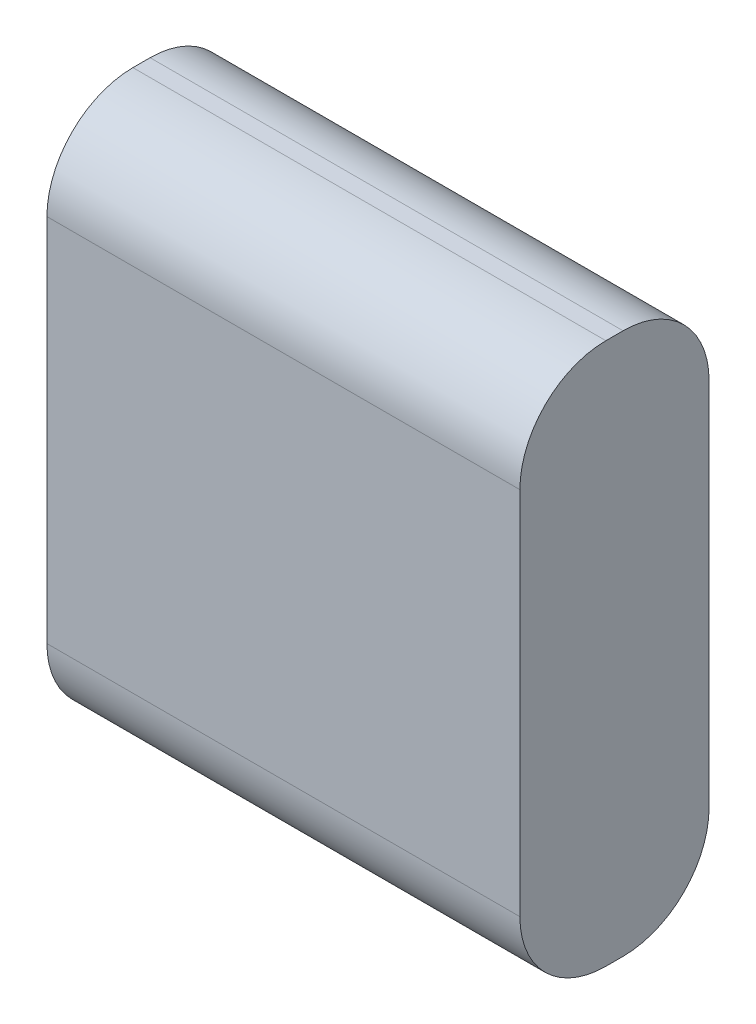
ISO-10303-21;
HEADER;
FILE_DESCRIPTION(('STEP AP214'),'2;1');
FILE_NAME('part.step','',(''),(''),'','','');
FILE_SCHEMA(('AUTOMOTIVE_DESIGN { 1 0 10303 214 1 1 1 1 }'));
ENDSEC;
DATA;
#1=APPLICATION_CONTEXT('core data for automotive mechanical design processes');
#2=APPLICATION_PROTOCOL_DEFINITION('international standard','automotive_design',2000,#1);
#3=PRODUCT_CONTEXT('',#1,'mechanical');
#4=PRODUCT('Part','Part','',(#3));
#5=PRODUCT_RELATED_PRODUCT_CATEGORY('part','',(#4));
#6=PRODUCT_DEFINITION_FORMATION('','',#4);
#7=PRODUCT_DEFINITION_CONTEXT('part definition',#1,'design');
#8=PRODUCT_DEFINITION('design','',#6,#7);
#9=PRODUCT_DEFINITION_SHAPE('','',#8);
#10=(LENGTH_UNIT() NAMED_UNIT(*) SI_UNIT(.MILLI.,.METRE.));
#11=(NAMED_UNIT(*) PLANE_ANGLE_UNIT() SI_UNIT($,.RADIAN.));
#12=(NAMED_UNIT(*) SI_UNIT($,.STERADIAN.) SOLID_ANGLE_UNIT());
#13=UNCERTAINTY_MEASURE_WITH_UNIT(LENGTH_MEASURE(1.E-05),#10,'distance_accuracy_value','');
#14=(GEOMETRIC_REPRESENTATION_CONTEXT(3) GLOBAL_UNCERTAINTY_ASSIGNED_CONTEXT((#13)) GLOBAL_UNIT_ASSIGNED_CONTEXT((#10,
#11,#12)) REPRESENTATION_CONTEXT('',''));
#15=CARTESIAN_POINT('',(0.,0.,0.));
#16=DIRECTION('',(0.,0.,1.));
#17=DIRECTION('',(1.,0.,0.));
#18=AXIS2_PLACEMENT_3D('',#15,#16,#17);
#19=CARTESIAN_POINT('',(8.95015274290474,27.3200326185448,2.2));
#20=DIRECTION('',(-1.,0.,0.));
#21=DIRECTION('',(0.,0.,1.));
#22=AXIS2_PLACEMENT_3D('',#19,#20,#21);
#23=PLANE('',#22);
#24=DIRECTION('',(0.,0.,-1.));
#25=VECTOR('',#24,1.);
#26=CARTESIAN_POINT('',(8.95015274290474,27.3200326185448,2.2));
#27=LINE('',#26,#25);
#28=CARTESIAN_POINT('',(8.95015274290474,27.3200326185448,1.2));
#29=VERTEX_POINT('',#28);
#30=CARTESIAN_POINT('',(8.95015274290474,27.3200326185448,1.));
#31=VERTEX_POINT('',#30);
#32=EDGE_CURVE('E85',#29,#31,#27,.T.);
#33=ORIENTED_EDGE('',*,*,#32,.T.);
#34=CARTESIAN_POINT('',(8.95015274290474,28.3200326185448,1.));
#35=DIRECTION('',(-1.,0.,0.));
#36=DIRECTION('',(0.,0.,1.));
#37=AXIS2_PLACEMENT_3D('',#34,#35,#36);
#38=CIRCLE('',#37,1.);
#39=CARTESIAN_POINT('',(8.95015274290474,28.3200326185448,0.));
#40=VERTEX_POINT('',#39);
#41=EDGE_CURVE('E92',#31,#40,#38,.F.);
#42=ORIENTED_EDGE('',*,*,#41,.T.);
#43=DIRECTION('',(0.,1.,0.));
#44=VECTOR('',#43,1.);
#45=CARTESIAN_POINT('',(8.95015274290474,27.3200326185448,0.));
#46=LINE('',#45,#44);
#47=CARTESIAN_POINT('',(8.95015274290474,32.6200326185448,0.));
#48=VERTEX_POINT('',#47);
#49=EDGE_CURVE('E146',#40,#48,#46,.T.);
#50=ORIENTED_EDGE('',*,*,#49,.T.);
#51=CARTESIAN_POINT('',(8.95015274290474,32.6200326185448,1.));
#52=DIRECTION('',(-1.,0.,0.));
#53=DIRECTION('',(0.,0.,1.));
#54=AXIS2_PLACEMENT_3D('',#51,#52,#53);
#55=CIRCLE('',#54,1.);
#56=CARTESIAN_POINT('',(8.95015274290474,33.6200326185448,1.));
#57=VERTEX_POINT('',#56);
#58=EDGE_CURVE('E111',#48,#57,#55,.F.);
#59=ORIENTED_EDGE('',*,*,#58,.T.);
#60=DIRECTION('',(0.,0.,-1.));
#61=VECTOR('',#60,1.);
#62=CARTESIAN_POINT('',(8.95015274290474,33.6200326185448,2.2));
#63=LINE('',#62,#61);
#64=CARTESIAN_POINT('',(8.95015274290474,33.6200326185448,1.2));
#65=VERTEX_POINT('',#64);
#66=EDGE_CURVE('E109',#65,#57,#63,.T.);
#67=ORIENTED_EDGE('',*,*,#66,.F.);
#68=CARTESIAN_POINT('',(8.95015274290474,32.6200326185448,1.2));
#69=DIRECTION('',(-1.,0.,0.));
#70=DIRECTION('',(0.,0.,1.));
#71=AXIS2_PLACEMENT_3D('',#68,#69,#70);
#72=CIRCLE('',#71,1.);
#73=CARTESIAN_POINT('',(8.95015274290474,32.6200326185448,2.2));
#74=VERTEX_POINT('',#73);
#75=EDGE_CURVE('E93',#65,#74,#72,.F.);
#76=ORIENTED_EDGE('',*,*,#75,.T.);
#77=DIRECTION('',(0.,1.,0.));
#78=VECTOR('',#77,1.);
#79=CARTESIAN_POINT('',(8.95015274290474,27.3200326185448,2.2));
#80=LINE('',#79,#78);
#81=CARTESIAN_POINT('',(8.95015274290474,28.3200326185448,2.2));
#82=VERTEX_POINT('',#81);
#83=EDGE_CURVE('E87',#82,#74,#80,.T.);
#84=ORIENTED_EDGE('',*,*,#83,.F.);
#85=CARTESIAN_POINT('',(8.95015274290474,28.3200326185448,1.2));
#86=DIRECTION('',(-1.,0.,0.));
#87=DIRECTION('',(0.,0.,1.));
#88=AXIS2_PLACEMENT_3D('',#85,#86,#87);
#89=CIRCLE('',#88,1.);
#90=EDGE_CURVE('E83',#82,#29,#89,.F.);
#91=ORIENTED_EDGE('',*,*,#90,.T.);
#92=EDGE_LOOP('',(#33,#42,#50,#59,#67,#76,#84,#91));
#93=FACE_BOUND('',#92,.T.);
#94=ADVANCED_FACE('F17',(#93),#23,.F.);
#95=CARTESIAN_POINT('',(8.95015274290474,33.6200326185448,2.2));
#96=DIRECTION('',(0.,-1.,0.));
#97=DIRECTION('',(0.,0.,-1.));
#98=AXIS2_PLACEMENT_3D('',#95,#96,#97);
#99=PLANE('',#98);
#100=DIRECTION('',(0.,0.,-1.));
#101=VECTOR('',#100,1.);
#102=CARTESIAN_POINT('',(3.45015274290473,33.6200326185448,2.2));
#103=LINE('',#102,#101);
#104=CARTESIAN_POINT('',(3.45015274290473,33.6200326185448,1.2));
#105=VERTEX_POINT('',#104);
#106=CARTESIAN_POINT('',(3.45015274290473,33.6200326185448,1.));
#107=VERTEX_POINT('',#106);
#108=EDGE_CURVE('E114',#105,#107,#103,.T.);
#109=ORIENTED_EDGE('',*,*,#108,.F.);
#110=DIRECTION('',(-1.,0.,0.));
#111=VECTOR('',#110,1.);
#112=CARTESIAN_POINT('',(8.95015274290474,33.6200326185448,1.2));
#113=LINE('',#112,#111);
#114=EDGE_CURVE('E11',#105,#65,#113,.F.);
#115=ORIENTED_EDGE('',*,*,#114,.T.);
#116=ORIENTED_EDGE('',*,*,#66,.T.);
#117=DIRECTION('',(-1.,0.,0.));
#118=VECTOR('',#117,1.);
#119=CARTESIAN_POINT('',(8.95015274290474,33.6200326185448,1.));
#120=LINE('',#119,#118);
#121=EDGE_CURVE('E25',#57,#107,#120,.T.);
#122=ORIENTED_EDGE('',*,*,#121,.T.);
#123=EDGE_LOOP('',(#109,#115,#116,#122));
#124=FACE_BOUND('',#123,.T.);
#125=ADVANCED_FACE('F135',(#124),#99,.F.);
#126=CARTESIAN_POINT('',(3.45015274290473,27.3200326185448,2.2));
#127=DIRECTION('',(1.,0.,0.));
#128=DIRECTION('',(0.,0.,-1.));
#129=AXIS2_PLACEMENT_3D('',#126,#127,#128);
#130=PLANE('',#129);
#131=DIRECTION('',(0.,-1.,0.));
#132=VECTOR('',#131,1.);
#133=CARTESIAN_POINT('',(3.45015274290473,27.3200326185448,0.));
#134=LINE('',#133,#132);
#135=CARTESIAN_POINT('',(3.45015274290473,32.6200326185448,0.));
#136=VERTEX_POINT('',#135);
#137=CARTESIAN_POINT('',(3.45015274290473,28.3200326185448,0.));
#138=VERTEX_POINT('',#137);
#139=EDGE_CURVE('E144',#136,#138,#134,.T.);
#140=ORIENTED_EDGE('',*,*,#139,.T.);
#141=CARTESIAN_POINT('',(3.45015274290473,28.3200326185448,1.));
#142=DIRECTION('',(1.,0.,0.));
#143=DIRECTION('',(0.,0.,-1.));
#144=AXIS2_PLACEMENT_3D('',#141,#142,#143);
#145=CIRCLE('',#144,1.);
#146=CARTESIAN_POINT('',(3.45015274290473,27.3200326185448,1.));
#147=VERTEX_POINT('',#146);
#148=EDGE_CURVE('E128',#138,#147,#145,.F.);
#149=ORIENTED_EDGE('',*,*,#148,.T.);
#150=DIRECTION('',(0.,0.,-1.));
#151=VECTOR('',#150,1.);
#152=CARTESIAN_POINT('',(3.45015274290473,27.3200326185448,2.2));
#153=LINE('',#152,#151);
#154=CARTESIAN_POINT('',(3.45015274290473,27.3200326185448,1.2));
#155=VERTEX_POINT('',#154);
#156=EDGE_CURVE('E103',#155,#147,#153,.T.);
#157=ORIENTED_EDGE('',*,*,#156,.F.);
#158=CARTESIAN_POINT('',(3.45015274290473,28.3200326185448,1.2));
#159=DIRECTION('',(1.,0.,0.));
#160=DIRECTION('',(0.,0.,-1.));
#161=AXIS2_PLACEMENT_3D('',#158,#159,#160);
#162=CIRCLE('',#161,1.);
#163=CARTESIAN_POINT('',(3.45015274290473,28.3200326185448,2.2));
#164=VERTEX_POINT('',#163);
#165=EDGE_CURVE('E108',#155,#164,#162,.F.);
#166=ORIENTED_EDGE('',*,*,#165,.T.);
#167=DIRECTION('',(0.,-1.,0.));
#168=VECTOR('',#167,1.);
#169=CARTESIAN_POINT('',(3.45015274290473,27.3200326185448,2.2));
#170=LINE('',#169,#168);
#171=CARTESIAN_POINT('',(3.45015274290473,32.6200326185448,2.2));
#172=VERTEX_POINT('',#171);
#173=EDGE_CURVE('E104',#172,#164,#170,.T.);
#174=ORIENTED_EDGE('',*,*,#173,.F.);
#175=CARTESIAN_POINT('',(3.45015274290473,32.6200326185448,1.2));
#176=DIRECTION('',(1.,0.,0.));
#177=DIRECTION('',(0.,0.,-1.));
#178=AXIS2_PLACEMENT_3D('',#175,#176,#177);
#179=CIRCLE('',#178,1.);
#180=EDGE_CURVE('E40',#172,#105,#179,.F.);
#181=ORIENTED_EDGE('',*,*,#180,.T.);
#182=ORIENTED_EDGE('',*,*,#108,.T.);
#183=CARTESIAN_POINT('',(3.45015274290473,32.6200326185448,1.));
#184=DIRECTION('',(1.,0.,0.));
#185=DIRECTION('',(0.,0.,-1.));
#186=AXIS2_PLACEMENT_3D('',#183,#184,#185);
#187=CIRCLE('',#186,1.);
#188=EDGE_CURVE('E32',#107,#136,#187,.F.);
#189=ORIENTED_EDGE('',*,*,#188,.T.);
#190=EDGE_LOOP('',(#140,#149,#157,#166,#174,#181,#182,#189));
#191=FACE_BOUND('',#190,.T.);
#192=ADVANCED_FACE('F140',(#191),#130,.F.);
#193=CARTESIAN_POINT('',(8.95015274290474,27.3200326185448,2.2));
#194=DIRECTION('',(0.,1.,0.));
#195=DIRECTION('',(-1.,0.,0.));
#196=AXIS2_PLACEMENT_3D('',#193,#194,#195);
#197=PLANE('',#196);
#198=ORIENTED_EDGE('',*,*,#156,.T.);
#199=DIRECTION('',(1.,0.,0.));
#200=VECTOR('',#199,1.);
#201=CARTESIAN_POINT('',(8.95015274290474,27.3200326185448,1.));
#202=LINE('',#201,#200);
#203=EDGE_CURVE('E102',#147,#31,#202,.T.);
#204=ORIENTED_EDGE('',*,*,#203,.T.);
#205=ORIENTED_EDGE('',*,*,#32,.F.);
#206=DIRECTION('',(1.,0.,0.));
#207=VECTOR('',#206,1.);
#208=CARTESIAN_POINT('',(3.45015274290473,27.3200326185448,1.2));
#209=LINE('',#208,#207);
#210=EDGE_CURVE('E99',#29,#155,#209,.F.);
#211=ORIENTED_EDGE('',*,*,#210,.T.);
#212=EDGE_LOOP('',(#198,#204,#205,#211));
#213=FACE_BOUND('',#212,.T.);
#214=ADVANCED_FACE('F98',(#213),#197,.F.);
#215=CARTESIAN_POINT('',(0.,0.,2.2));
#216=DIRECTION('',(0.,0.,1.));
#217=DIRECTION('',(1.,0.,0.));
#218=AXIS2_PLACEMENT_3D('',#215,#216,#217);
#219=PLANE('',#218);
#220=ORIENTED_EDGE('',*,*,#173,.T.);
#221=DIRECTION('',(1.,0.,0.));
#222=VECTOR('',#221,1.);
#223=CARTESIAN_POINT('',(8.95015274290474,28.3200326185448,2.2));
#224=LINE('',#223,#222);
#225=EDGE_CURVE('E133',#164,#82,#224,.T.);
#226=ORIENTED_EDGE('',*,*,#225,.T.);
#227=ORIENTED_EDGE('',*,*,#83,.T.);
#228=DIRECTION('',(-1.,0.,0.));
#229=VECTOR('',#228,1.);
#230=CARTESIAN_POINT('',(3.45015274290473,32.6200326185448,2.2));
#231=LINE('',#230,#229);
#232=EDGE_CURVE('E130',#74,#172,#231,.T.);
#233=ORIENTED_EDGE('',*,*,#232,.T.);
#234=EDGE_LOOP('',(#220,#226,#227,#233));
#235=FACE_BOUND('',#234,.T.);
#236=ADVANCED_FACE('F153',(#235),#219,.T.);
#237=CARTESIAN_POINT('',(0.,0.,0.));
#238=DIRECTION('',(0.,0.,1.));
#239=DIRECTION('',(1.,0.,0.));
#240=AXIS2_PLACEMENT_3D('',#237,#238,#239);
#241=PLANE('',#240);
#242=ORIENTED_EDGE('',*,*,#49,.F.);
#243=DIRECTION('',(1.,0.,0.));
#244=VECTOR('',#243,1.);
#245=CARTESIAN_POINT('',(0.,28.3200326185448,0.));
#246=LINE('',#245,#244);
#247=EDGE_CURVE('E123',#40,#138,#246,.F.);
#248=ORIENTED_EDGE('',*,*,#247,.T.);
#249=ORIENTED_EDGE('',*,*,#139,.F.);
#250=DIRECTION('',(-1.,0.,0.));
#251=VECTOR('',#250,1.);
#252=CARTESIAN_POINT('',(0.,32.6200326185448,0.));
#253=LINE('',#252,#251);
#254=EDGE_CURVE('E121',#136,#48,#253,.F.);
#255=ORIENTED_EDGE('',*,*,#254,.T.);
#256=EDGE_LOOP('',(#242,#248,#249,#255));
#257=FACE_BOUND('',#256,.T.);
#258=ADVANCED_FACE('F159',(#257),#241,.F.);
#259=CARTESIAN_POINT('',(8.95015274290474,28.3200326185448,1.));
#260=DIRECTION('',(1.,0.,0.));
#261=DIRECTION('',(0.,1.,0.));
#262=AXIS2_PLACEMENT_3D('',#259,#260,#261);
#263=CYLINDRICAL_SURFACE('',#262,1.);
#264=ORIENTED_EDGE('',*,*,#148,.F.);
#265=ORIENTED_EDGE('',*,*,#247,.F.);
#266=ORIENTED_EDGE('',*,*,#41,.F.);
#267=ORIENTED_EDGE('',*,*,#203,.F.);
#268=EDGE_LOOP('',(#264,#265,#266,#267));
#269=FACE_BOUND('',#268,.T.);
#270=ADVANCED_FACE('F163',(#269),#263,.T.);
#271=CARTESIAN_POINT('',(0.,28.3200326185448,1.2));
#272=DIRECTION('',(-1.,0.,0.));
#273=DIRECTION('',(0.,-1.,0.));
#274=AXIS2_PLACEMENT_3D('',#271,#272,#273);
#275=CYLINDRICAL_SURFACE('',#274,1.);
#276=ORIENTED_EDGE('',*,*,#165,.F.);
#277=ORIENTED_EDGE('',*,*,#210,.F.);
#278=ORIENTED_EDGE('',*,*,#90,.F.);
#279=ORIENTED_EDGE('',*,*,#225,.F.);
#280=EDGE_LOOP('',(#276,#277,#278,#279));
#281=FACE_BOUND('',#280,.T.);
#282=ADVANCED_FACE('F107',(#281),#275,.T.);
#283=CARTESIAN_POINT('',(0.,32.6200326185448,1.2));
#284=DIRECTION('',(1.,0.,0.));
#285=DIRECTION('',(0.,0.,-1.));
#286=AXIS2_PLACEMENT_3D('',#283,#284,#285);
#287=CYLINDRICAL_SURFACE('',#286,1.);
#288=ORIENTED_EDGE('',*,*,#75,.F.);
#289=ORIENTED_EDGE('',*,*,#114,.F.);
#290=ORIENTED_EDGE('',*,*,#180,.F.);
#291=ORIENTED_EDGE('',*,*,#232,.F.);
#292=EDGE_LOOP('',(#288,#289,#290,#291));
#293=FACE_BOUND('',#292,.T.);
#294=ADVANCED_FACE('F156',(#293),#287,.T.);
#295=CARTESIAN_POINT('',(8.95015274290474,32.6200326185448,1.));
#296=DIRECTION('',(-1.,0.,0.));
#297=DIRECTION('',(0.,0.,1.));
#298=AXIS2_PLACEMENT_3D('',#295,#296,#297);
#299=CYLINDRICAL_SURFACE('',#298,1.);
#300=ORIENTED_EDGE('',*,*,#58,.F.);
#301=ORIENTED_EDGE('',*,*,#254,.F.);
#302=ORIENTED_EDGE('',*,*,#188,.F.);
#303=ORIENTED_EDGE('',*,*,#121,.F.);
#304=EDGE_LOOP('',(#300,#301,#302,#303));
#305=FACE_BOUND('',#304,.T.);
#306=ADVANCED_FACE('F19',(#305),#299,.T.);
#307=CLOSED_SHELL('',(#94,#125,#192,#214,#236,#258,#270,#282,#294,#306));
#308=MANIFOLD_SOLID_BREP('B1',#307);
#309=ADVANCED_BREP_SHAPE_REPRESENTATION('',(#18,#308),#14);
#310=SHAPE_DEFINITION_REPRESENTATION(#9,#309);
ENDSEC;
END-ISO-10303-21;
